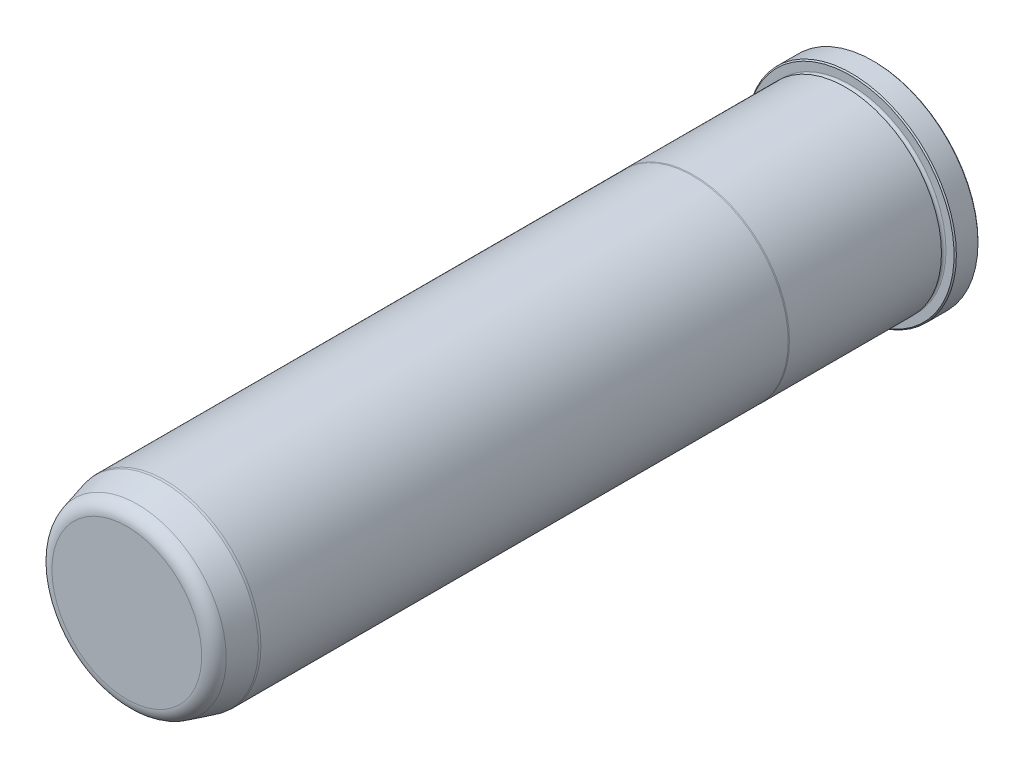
from build123d import *

# Parameters (mm, degrees)
FILLET6_R     = 4.7625
CHAMFER1_SIZE = 0.381


with BuildPart() as part:
    # Sketch1 → Revolve1 (revolve)
    with BuildSketch(Plane(origin=(0, 0, 0), x_dir=(0, 0, -1), z_dir=(1, 0, 0)), mode=Mode.PRIVATE) as revolve1_sk:
        with BuildLine():
            Line((0, 0), (0, 34.798))
            Line((0, 34.798), (-7.9248, 34.798))
            Line((-7.9248, 34.798), (-7.9248, 31.7373))
            ThreePointArc((-7.9248, 31.7373), (-8.6868, 30.9753), (-9.4488, 31.7373))
            Line((-9.4488, 31.7373), (-9.4488, 31.7627))
            Line((-9.4488, 31.7627), (-59.834763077, 31.7627))
            Line((-59.834763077, 31.7627), (-60.198, 31.7373))
            Line((-60.198, 31.7373), (-234.95, 31.7373))
            Line((-234.95, 31.7373), (-235.712, 31.670633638))
            Line((-235.712, 31.670633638), (-247.65, 28.471856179))
            Line((-247.65, 28.471856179), (-247.65, 0))
            Line((-247.65, 0), (0, 0))
        make_face()
    revolve(revolve1_sk.sketch.rotate(Axis((0, 0, 0), (0, 0, -1)), 90), axis=Axis((0, 0, 0), (0, 0, -1)))

    # Fillet6
    fillet6_edges = [part.edges().sort_by_distance(p)[0] for p in [
        (-28.471856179, 0, 247.65),
    ]]
    fillet(fillet6_edges, radius=FILLET6_R)

    # Chamfer1
    chamfer1_edges = [part.edges().sort_by_distance(p)[0] for p in [
        (-34.798, 0, 7.9248),
        (-34.798, 0, 0),
    ]]
    chamfer(chamfer1_edges, length=CHAMFER1_SIZE)


solid = part.part
